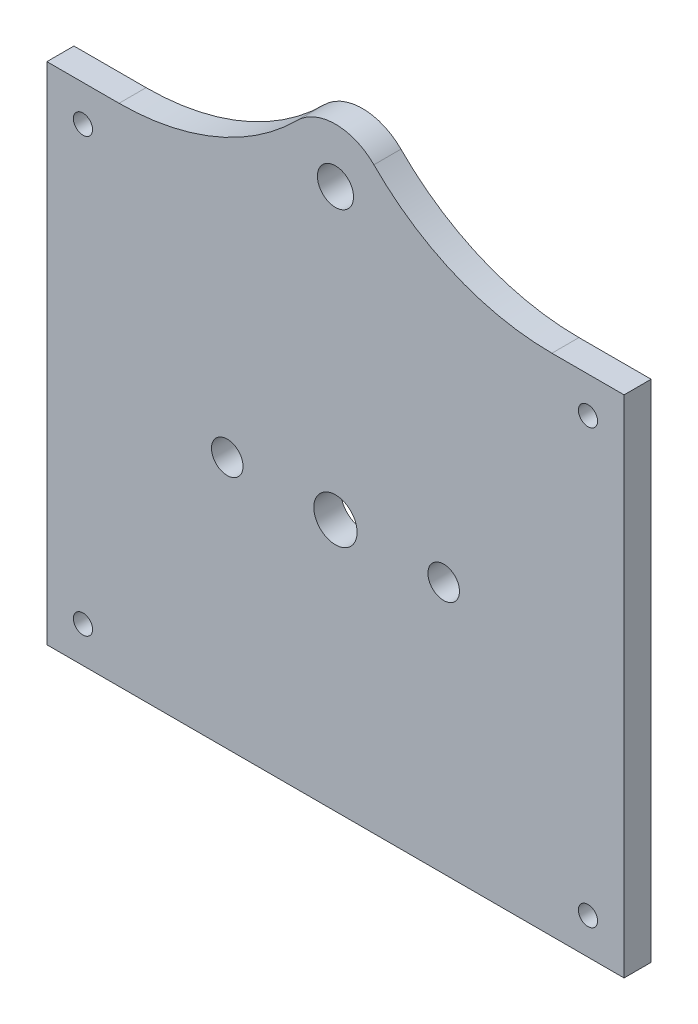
from build123d import *

# Parameters (mm, degrees)
SKETCH1_R                  = 5.55625
BOSS_EXTRUDE1_DEPTH        = 9.525
F_1_4_CLEARANCE_HOLE1_D    = 6.7564
F_1_2_0_5000_DOWEL_HOLE2_D = 12.7
SKETCH14_R                 = 7.62
CUT_EXTRUDE1_DEPTH         = 159.018062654


with BuildPart() as part:
    # Sketch1 → Boss-Extrude1 (new body)
    with BuildSketch(Plane.XY):
        with BuildLine():
            Line((-101.6, -88.9), (101.6, -88.9))
            Line((101.6, -88.9), (101.6, 88.9))
            Line((101.6, 88.9), (76.2, 88.9))
            ThreePointArc((76.2, 88.9), (42.251923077, 95.689615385), (13.526627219, 115.013905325))
            ThreePointArc((13.526627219, 115.013905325), (0, 120.65), (-13.526627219, 115.013905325))
            ThreePointArc((-13.526627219, 115.013905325), (-42.251923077, 95.689615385), (-76.2, 88.9))
            Line((-76.2, 88.9), (-101.6, 88.9))
            Line((-101.6, 88.9), (-101.6, -88.9))
        make_face()
        with Locations(Location((-38.1, 0, 0), (0, 0, 180))):
            Circle(SKETCH1_R, mode=Mode.SUBTRACT)
        with Locations(Location((38.1, 0, 0), (0, 0, 180))):
            Circle(SKETCH1_R, mode=Mode.SUBTRACT)
    extrude(amount=BOSS_EXTRUDE1_DEPTH)

    # 1_4 Clearance Hole1 (through all)
    with Locations(Plane.XY.offset(9.525)):
        with Locations((88.9, 76.2), (-88.9, -76.2), (-88.9, 76.2), (88.9, -76.2)):
            Hole(F_1_4_CLEARANCE_HOLE1_D / 2)

    # 1_2 _0.5000_ Dowel Hole2 (through all)
    with Locations(Plane.XY.offset(9.525)):
        with Locations((0, 101.6)):
            Hole(F_1_2_0_5000_DOWEL_HOLE2_D / 2)

    # Sketch14 → Cut-Extrude1 (cut, through all)
    with BuildSketch(Plane.XY.offset(9.525)):
        Circle(SKETCH14_R)
    extrude(amount=-CUT_EXTRUDE1_DEPTH, mode=Mode.SUBTRACT)


solid = part.part
